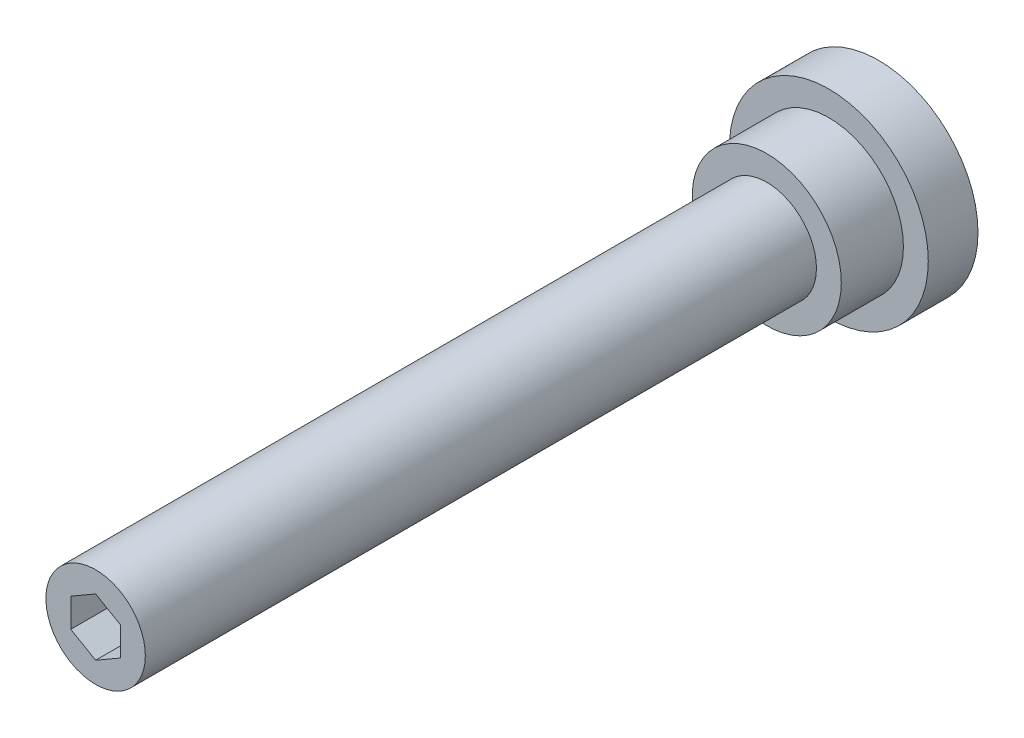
ISO-10303-21;
HEADER;
FILE_DESCRIPTION(('STEP AP214'),'2;1');
FILE_NAME('part.step','',(''),(''),'','','');
FILE_SCHEMA(('AUTOMOTIVE_DESIGN { 1 0 10303 214 1 1 1 1 }'));
ENDSEC;
DATA;
#1=APPLICATION_CONTEXT('core data for automotive mechanical design processes');
#2=APPLICATION_PROTOCOL_DEFINITION('international standard','automotive_design',2000,#1);
#3=PRODUCT_CONTEXT('',#1,'mechanical');
#4=PRODUCT('Part','Part','',(#3));
#5=PRODUCT_RELATED_PRODUCT_CATEGORY('part','',(#4));
#6=PRODUCT_DEFINITION_FORMATION('','',#4);
#7=PRODUCT_DEFINITION_CONTEXT('part definition',#1,'design');
#8=PRODUCT_DEFINITION('design','',#6,#7);
#9=PRODUCT_DEFINITION_SHAPE('','',#8);
#10=(LENGTH_UNIT() NAMED_UNIT(*) SI_UNIT(.MILLI.,.METRE.));
#11=(NAMED_UNIT(*) PLANE_ANGLE_UNIT() SI_UNIT($,.RADIAN.));
#12=(NAMED_UNIT(*) SI_UNIT($,.STERADIAN.) SOLID_ANGLE_UNIT());
#13=UNCERTAINTY_MEASURE_WITH_UNIT(LENGTH_MEASURE(1.E-05),#10,'distance_accuracy_value','');
#14=(GEOMETRIC_REPRESENTATION_CONTEXT(3) GLOBAL_UNCERTAINTY_ASSIGNED_CONTEXT((#13)) GLOBAL_UNIT_ASSIGNED_CONTEXT((#10,
#11,#12)) REPRESENTATION_CONTEXT('',''));
#15=CARTESIAN_POINT('',(0.,0.,0.));
#16=DIRECTION('',(0.,0.,1.));
#17=DIRECTION('',(1.,0.,0.));
#18=AXIS2_PLACEMENT_3D('',#15,#16,#17);
#19=CARTESIAN_POINT('',(0.,0.,63.));
#20=DIRECTION('',(0.,0.,1.));
#21=DIRECTION('',(1.,0.,0.));
#22=AXIS2_PLACEMENT_3D('',#19,#20,#21);
#23=PLANE('',#22);
#24=DIRECTION('',(-0.866025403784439,0.5,0.));
#25=VECTOR('',#24,1.);
#26=CARTESIAN_POINT('',(2.,1.15470053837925,63.));
#27=LINE('',#26,#25);
#28=CARTESIAN_POINT('',(2.,1.15470053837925,63.));
#29=VERTEX_POINT('',#28);
#30=CARTESIAN_POINT('',(0.,2.30940107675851,63.));
#31=VERTEX_POINT('',#30);
#32=EDGE_CURVE('E28',#29,#31,#27,.T.);
#33=ORIENTED_EDGE('',*,*,#32,.F.);
#34=DIRECTION('',(0.,1.,0.));
#35=VECTOR('',#34,1.);
#36=CARTESIAN_POINT('',(2.,-1.15470053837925,63.));
#37=LINE('',#36,#35);
#38=CARTESIAN_POINT('',(2.,-1.15470053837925,63.));
#39=VERTEX_POINT('',#38);
#40=EDGE_CURVE('E111',#39,#29,#37,.T.);
#41=ORIENTED_EDGE('',*,*,#40,.F.);
#42=DIRECTION('',(0.866025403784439,0.5,0.));
#43=VECTOR('',#42,1.);
#44=CARTESIAN_POINT('',(0.,-2.30940107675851,63.));
#45=LINE('',#44,#43);
#46=CARTESIAN_POINT('',(0.,-2.30940107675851,63.));
#47=VERTEX_POINT('',#46);
#48=EDGE_CURVE('E109',#47,#39,#45,.T.);
#49=ORIENTED_EDGE('',*,*,#48,.F.);
#50=DIRECTION('',(0.866025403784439,-0.5,0.));
#51=VECTOR('',#50,1.);
#52=CARTESIAN_POINT('',(-2.,-1.15470053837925,63.));
#53=LINE('',#52,#51);
#54=CARTESIAN_POINT('',(-2.,-1.15470053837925,63.));
#55=VERTEX_POINT('',#54);
#56=EDGE_CURVE('E76',#55,#47,#53,.T.);
#57=ORIENTED_EDGE('',*,*,#56,.F.);
#58=DIRECTION('',(0.,-1.,0.));
#59=VECTOR('',#58,1.);
#60=CARTESIAN_POINT('',(-2.,1.15470053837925,63.));
#61=LINE('',#60,#59);
#62=CARTESIAN_POINT('',(-2.,1.15470053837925,63.));
#63=VERTEX_POINT('',#62);
#64=EDGE_CURVE('E105',#63,#55,#61,.T.);
#65=ORIENTED_EDGE('',*,*,#64,.F.);
#66=DIRECTION('',(-0.866025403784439,-0.5,0.));
#67=VECTOR('',#66,1.);
#68=CARTESIAN_POINT('',(0.,2.30940107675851,63.));
#69=LINE('',#68,#67);
#70=EDGE_CURVE('E102',#31,#63,#69,.T.);
#71=ORIENTED_EDGE('',*,*,#70,.F.);
#72=EDGE_LOOP('',(#33,#41,#49,#57,#65,#71));
#73=FACE_BOUND('',#72,.T.);
#74=CARTESIAN_POINT('',(0.,0.,63.));
#75=DIRECTION('',(0.,0.,1.));
#76=DIRECTION('',(1.,0.,0.));
#77=AXIS2_PLACEMENT_3D('',#74,#75,#76);
#78=CIRCLE('',#77,4.);
#79=CARTESIAN_POINT('',(4.,0.,63.));
#80=VERTEX_POINT('',#79);
#81=EDGE_CURVE('E9',#80,#80,#78,.T.);
#82=ORIENTED_EDGE('',*,*,#81,.T.);
#83=EDGE_LOOP('',(#82));
#84=FACE_BOUND('',#83,.T.);
#85=ADVANCED_FACE('F14',(#73,#84),#23,.T.);
#86=CARTESIAN_POINT('',(0.,0.,30.));
#87=DIRECTION('',(0.,0.,1.));
#88=DIRECTION('',(1.,0.,0.));
#89=AXIS2_PLACEMENT_3D('',#86,#87,#88);
#90=CYLINDRICAL_SURFACE('',#89,4.);
#91=CARTESIAN_POINT('',(0.,0.,9.));
#92=DIRECTION('',(0.,0.,1.));
#93=DIRECTION('',(1.,0.,0.));
#94=AXIS2_PLACEMENT_3D('',#91,#92,#93);
#95=CIRCLE('',#94,4.);
#96=CARTESIAN_POINT('',(4.,0.,9.));
#97=VERTEX_POINT('',#96);
#98=EDGE_CURVE('E21',#97,#97,#95,.T.);
#99=ORIENTED_EDGE('',*,*,#98,.T.);
#100=EDGE_LOOP('',(#99));
#101=FACE_BOUND('',#100,.T.);
#102=ORIENTED_EDGE('',*,*,#81,.F.);
#103=EDGE_LOOP('',(#102));
#104=FACE_BOUND('',#103,.T.);
#105=ADVANCED_FACE('F134',(#101,#104),#90,.T.);
#106=CARTESIAN_POINT('',(-4.,0.,9.));
#107=DIRECTION('',(0.,0.,1.));
#108=DIRECTION('',(1.,0.,0.));
#109=AXIS2_PLACEMENT_3D('',#106,#107,#108);
#110=PLANE('',#109);
#111=CARTESIAN_POINT('',(0.,0.,9.));
#112=DIRECTION('',(0.,0.,1.));
#113=DIRECTION('',(1.,0.,0.));
#114=AXIS2_PLACEMENT_3D('',#111,#112,#113);
#115=CIRCLE('',#114,6.);
#116=CARTESIAN_POINT('',(6.,0.,9.));
#117=VERTEX_POINT('',#116);
#118=EDGE_CURVE('E129',#117,#117,#115,.T.);
#119=ORIENTED_EDGE('',*,*,#118,.T.);
#120=EDGE_LOOP('',(#119));
#121=FACE_BOUND('',#120,.T.);
#122=ORIENTED_EDGE('',*,*,#98,.F.);
#123=EDGE_LOOP('',(#122));
#124=FACE_BOUND('',#123,.T.);
#125=ADVANCED_FACE('F137',(#121,#124),#110,.T.);
#126=CARTESIAN_POINT('',(0.,0.,30.));
#127=DIRECTION('',(0.,0.,1.));
#128=DIRECTION('',(1.,0.,0.));
#129=AXIS2_PLACEMENT_3D('',#126,#127,#128);
#130=CYLINDRICAL_SURFACE('',#129,6.);
#131=CARTESIAN_POINT('',(0.,0.,4.));
#132=DIRECTION('',(0.,0.,1.));
#133=DIRECTION('',(1.,0.,0.));
#134=AXIS2_PLACEMENT_3D('',#131,#132,#133);
#135=CIRCLE('',#134,6.);
#136=CARTESIAN_POINT('',(6.,0.,4.));
#137=VERTEX_POINT('',#136);
#138=EDGE_CURVE('E126',#137,#137,#135,.T.);
#139=ORIENTED_EDGE('',*,*,#138,.T.);
#140=EDGE_LOOP('',(#139));
#141=FACE_BOUND('',#140,.T.);
#142=ORIENTED_EDGE('',*,*,#118,.F.);
#143=EDGE_LOOP('',(#142));
#144=FACE_BOUND('',#143,.T.);
#145=ADVANCED_FACE('F139',(#141,#144),#130,.T.);
#146=CARTESIAN_POINT('',(-6.,0.,4.));
#147=DIRECTION('',(0.,0.,1.));
#148=DIRECTION('',(1.,0.,0.));
#149=AXIS2_PLACEMENT_3D('',#146,#147,#148);
#150=PLANE('',#149);
#151=CARTESIAN_POINT('',(0.,0.,4.));
#152=DIRECTION('',(0.,0.,1.));
#153=DIRECTION('',(1.,0.,0.));
#154=AXIS2_PLACEMENT_3D('',#151,#152,#153);
#155=CIRCLE('',#154,8.);
#156=CARTESIAN_POINT('',(8.,0.,4.));
#157=VERTEX_POINT('',#156);
#158=EDGE_CURVE('E123',#157,#157,#155,.T.);
#159=ORIENTED_EDGE('',*,*,#158,.T.);
#160=EDGE_LOOP('',(#159));
#161=FACE_BOUND('',#160,.T.);
#162=ORIENTED_EDGE('',*,*,#138,.F.);
#163=EDGE_LOOP('',(#162));
#164=FACE_BOUND('',#163,.T.);
#165=ADVANCED_FACE('F147',(#161,#164),#150,.T.);
#166=CARTESIAN_POINT('',(0.,0.,30.));
#167=DIRECTION('',(0.,0.,1.));
#168=DIRECTION('',(1.,0.,0.));
#169=AXIS2_PLACEMENT_3D('',#166,#167,#168);
#170=CYLINDRICAL_SURFACE('',#169,8.);
#171=CARTESIAN_POINT('',(0.,0.,0.));
#172=DIRECTION('',(0.,0.,1.));
#173=DIRECTION('',(1.,0.,0.));
#174=AXIS2_PLACEMENT_3D('',#171,#172,#173);
#175=CIRCLE('',#174,8.);
#176=CARTESIAN_POINT('',(8.,0.,0.));
#177=VERTEX_POINT('',#176);
#178=EDGE_CURVE('E115',#177,#177,#175,.T.);
#179=ORIENTED_EDGE('',*,*,#178,.T.);
#180=EDGE_LOOP('',(#179));
#181=FACE_BOUND('',#180,.T.);
#182=ORIENTED_EDGE('',*,*,#158,.F.);
#183=EDGE_LOOP('',(#182));
#184=FACE_BOUND('',#183,.T.);
#185=ADVANCED_FACE('F172',(#181,#184),#170,.T.);
#186=CARTESIAN_POINT('',(-8.,0.,0.));
#187=DIRECTION('',(0.,0.,-1.));
#188=DIRECTION('',(-1.,0.,0.));
#189=AXIS2_PLACEMENT_3D('',#186,#187,#188);
#190=PLANE('',#189);
#191=ORIENTED_EDGE('',*,*,#178,.F.);
#192=EDGE_LOOP('',(#191));
#193=FACE_BOUND('',#192,.T.);
#194=ADVANCED_FACE('F165',(#193),#190,.T.);
#195=CARTESIAN_POINT('',(2.,1.15470053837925,59.));
#196=DIRECTION('',(0.5,0.866025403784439,0.));
#197=DIRECTION('',(-0.866025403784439,0.5,0.));
#198=AXIS2_PLACEMENT_3D('',#195,#196,#197);
#199=PLANE('',#198);
#200=ORIENTED_EDGE('',*,*,#32,.T.);
#201=DIRECTION('',(0.,0.,1.));
#202=VECTOR('',#201,1.);
#203=CARTESIAN_POINT('',(0.,2.30940107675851,59.));
#204=LINE('',#203,#202);
#205=CARTESIAN_POINT('',(0.,2.30940107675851,59.));
#206=VERTEX_POINT('',#205);
#207=EDGE_CURVE('E58',#206,#31,#204,.T.);
#208=ORIENTED_EDGE('',*,*,#207,.F.);
#209=DIRECTION('',(-0.866025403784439,0.5,0.));
#210=VECTOR('',#209,1.);
#211=CARTESIAN_POINT('',(2.,1.15470053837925,59.));
#212=LINE('',#211,#210);
#213=CARTESIAN_POINT('',(2.,1.15470053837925,59.));
#214=VERTEX_POINT('',#213);
#215=EDGE_CURVE('E113',#214,#206,#212,.T.);
#216=ORIENTED_EDGE('',*,*,#215,.F.);
#217=DIRECTION('',(0.,0.,1.));
#218=VECTOR('',#217,1.);
#219=CARTESIAN_POINT('',(2.,1.15470053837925,59.));
#220=LINE('',#219,#218);
#221=EDGE_CURVE('E36',#214,#29,#220,.T.);
#222=ORIENTED_EDGE('',*,*,#221,.T.);
#223=EDGE_LOOP('',(#200,#208,#216,#222));
#224=FACE_BOUND('',#223,.T.);
#225=ADVANCED_FACE('F162',(#224),#199,.F.);
#226=CARTESIAN_POINT('',(2.,-1.15470053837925,59.));
#227=DIRECTION('',(1.,0.,0.));
#228=DIRECTION('',(0.,0.,-1.));
#229=AXIS2_PLACEMENT_3D('',#226,#227,#228);
#230=PLANE('',#229);
#231=ORIENTED_EDGE('',*,*,#40,.T.);
#232=ORIENTED_EDGE('',*,*,#221,.F.);
#233=DIRECTION('',(0.,1.,0.));
#234=VECTOR('',#233,1.);
#235=CARTESIAN_POINT('',(2.,-1.15470053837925,59.));
#236=LINE('',#235,#234);
#237=CARTESIAN_POINT('',(2.,-1.15470053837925,59.));
#238=VERTEX_POINT('',#237);
#239=EDGE_CURVE('E88',#238,#214,#236,.T.);
#240=ORIENTED_EDGE('',*,*,#239,.F.);
#241=DIRECTION('',(0.,0.,1.));
#242=VECTOR('',#241,1.);
#243=CARTESIAN_POINT('',(2.,-1.15470053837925,59.));
#244=LINE('',#243,#242);
#245=EDGE_CURVE('E80',#238,#39,#244,.T.);
#246=ORIENTED_EDGE('',*,*,#245,.T.);
#247=EDGE_LOOP('',(#231,#232,#240,#246));
#248=FACE_BOUND('',#247,.T.);
#249=ADVANCED_FACE('F164',(#248),#230,.F.);
#250=CARTESIAN_POINT('',(0.,-2.30940107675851,59.));
#251=DIRECTION('',(0.5,-0.866025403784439,0.));
#252=DIRECTION('',(0.866025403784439,0.5,0.));
#253=AXIS2_PLACEMENT_3D('',#250,#251,#252);
#254=PLANE('',#253);
#255=ORIENTED_EDGE('',*,*,#48,.T.);
#256=ORIENTED_EDGE('',*,*,#245,.F.);
#257=DIRECTION('',(0.866025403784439,0.5,0.));
#258=VECTOR('',#257,1.);
#259=CARTESIAN_POINT('',(0.,-2.30940107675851,59.));
#260=LINE('',#259,#258);
#261=CARTESIAN_POINT('',(0.,-2.30940107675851,59.));
#262=VERTEX_POINT('',#261);
#263=EDGE_CURVE('E84',#262,#238,#260,.T.);
#264=ORIENTED_EDGE('',*,*,#263,.F.);
#265=DIRECTION('',(0.,0.,1.));
#266=VECTOR('',#265,1.);
#267=CARTESIAN_POINT('',(0.,-2.30940107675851,59.));
#268=LINE('',#267,#266);
#269=EDGE_CURVE('E69',#262,#47,#268,.T.);
#270=ORIENTED_EDGE('',*,*,#269,.T.);
#271=EDGE_LOOP('',(#255,#256,#264,#270));
#272=FACE_BOUND('',#271,.T.);
#273=ADVANCED_FACE('F85',(#272),#254,.F.);
#274=CARTESIAN_POINT('',(-2.,-1.15470053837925,59.));
#275=DIRECTION('',(-0.5,-0.866025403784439,0.));
#276=DIRECTION('',(0.866025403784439,-0.5,0.));
#277=AXIS2_PLACEMENT_3D('',#274,#275,#276);
#278=PLANE('',#277);
#279=ORIENTED_EDGE('',*,*,#56,.T.);
#280=ORIENTED_EDGE('',*,*,#269,.F.);
#281=DIRECTION('',(0.866025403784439,-0.5,0.));
#282=VECTOR('',#281,1.);
#283=CARTESIAN_POINT('',(-2.,-1.15470053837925,59.));
#284=LINE('',#283,#282);
#285=CARTESIAN_POINT('',(-2.,-1.15470053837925,59.));
#286=VERTEX_POINT('',#285);
#287=EDGE_CURVE('E73',#286,#262,#284,.T.);
#288=ORIENTED_EDGE('',*,*,#287,.F.);
#289=DIRECTION('',(0.,0.,1.));
#290=VECTOR('',#289,1.);
#291=CARTESIAN_POINT('',(-2.,-1.15470053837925,59.));
#292=LINE('',#291,#290);
#293=EDGE_CURVE('E81',#286,#55,#292,.T.);
#294=ORIENTED_EDGE('',*,*,#293,.T.);
#295=EDGE_LOOP('',(#279,#280,#288,#294));
#296=FACE_BOUND('',#295,.T.);
#297=ADVANCED_FACE('F71',(#296),#278,.F.);
#298=CARTESIAN_POINT('',(-2.,1.15470053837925,59.));
#299=DIRECTION('',(-1.,0.,0.));
#300=DIRECTION('',(0.,-1.,0.));
#301=AXIS2_PLACEMENT_3D('',#298,#299,#300);
#302=PLANE('',#301);
#303=ORIENTED_EDGE('',*,*,#64,.T.);
#304=ORIENTED_EDGE('',*,*,#293,.F.);
#305=DIRECTION('',(0.,-1.,0.));
#306=VECTOR('',#305,1.);
#307=CARTESIAN_POINT('',(-2.,1.15470053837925,59.));
#308=LINE('',#307,#306);
#309=CARTESIAN_POINT('',(-2.,1.15470053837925,59.));
#310=VERTEX_POINT('',#309);
#311=EDGE_CURVE('E94',#310,#286,#308,.T.);
#312=ORIENTED_EDGE('',*,*,#311,.F.);
#313=DIRECTION('',(0.,0.,1.));
#314=VECTOR('',#313,1.);
#315=CARTESIAN_POINT('',(-2.,1.15470053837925,59.));
#316=LINE('',#315,#314);
#317=EDGE_CURVE('E118',#310,#63,#316,.T.);
#318=ORIENTED_EDGE('',*,*,#317,.T.);
#319=EDGE_LOOP('',(#303,#304,#312,#318));
#320=FACE_BOUND('',#319,.T.);
#321=ADVANCED_FACE('F237',(#320),#302,.F.);
#322=CARTESIAN_POINT('',(0.,2.30940107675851,59.));
#323=DIRECTION('',(-0.5,0.866025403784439,0.));
#324=DIRECTION('',(-0.866025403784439,-0.5,0.));
#325=AXIS2_PLACEMENT_3D('',#322,#323,#324);
#326=PLANE('',#325);
#327=ORIENTED_EDGE('',*,*,#70,.T.);
#328=ORIENTED_EDGE('',*,*,#317,.F.);
#329=DIRECTION('',(-0.866025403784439,-0.5,0.));
#330=VECTOR('',#329,1.);
#331=CARTESIAN_POINT('',(0.,2.30940107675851,59.));
#332=LINE('',#331,#330);
#333=EDGE_CURVE('E96',#206,#310,#332,.T.);
#334=ORIENTED_EDGE('',*,*,#333,.F.);
#335=ORIENTED_EDGE('',*,*,#207,.T.);
#336=EDGE_LOOP('',(#327,#328,#334,#335));
#337=FACE_BOUND('',#336,.T.);
#338=ADVANCED_FACE('F160',(#337),#326,.F.);
#339=CARTESIAN_POINT('',(0.,2.30940107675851,59.));
#340=DIRECTION('',(0.,0.,1.));
#341=DIRECTION('',(1.,0.,0.));
#342=AXIS2_PLACEMENT_3D('',#339,#340,#341);
#343=PLANE('',#342);
#344=ORIENTED_EDGE('',*,*,#215,.T.);
#345=ORIENTED_EDGE('',*,*,#333,.T.);
#346=ORIENTED_EDGE('',*,*,#311,.T.);
#347=ORIENTED_EDGE('',*,*,#287,.T.);
#348=ORIENTED_EDGE('',*,*,#263,.T.);
#349=ORIENTED_EDGE('',*,*,#239,.T.);
#350=EDGE_LOOP('',(#344,#345,#346,#347,#348,#349));
#351=FACE_BOUND('',#350,.T.);
#352=ADVANCED_FACE('F91',(#351),#343,.T.);
#353=CLOSED_SHELL('',(#85,#105,#125,#145,#165,#185,#194,#225,#249,#273,#297,#321,#338,#352));
#354=MANIFOLD_SOLID_BREP('B1',#353);
#355=ADVANCED_BREP_SHAPE_REPRESENTATION('',(#18,#354),#14);
#356=SHAPE_DEFINITION_REPRESENTATION(#9,#355);
ENDSEC;
END-ISO-10303-21;
